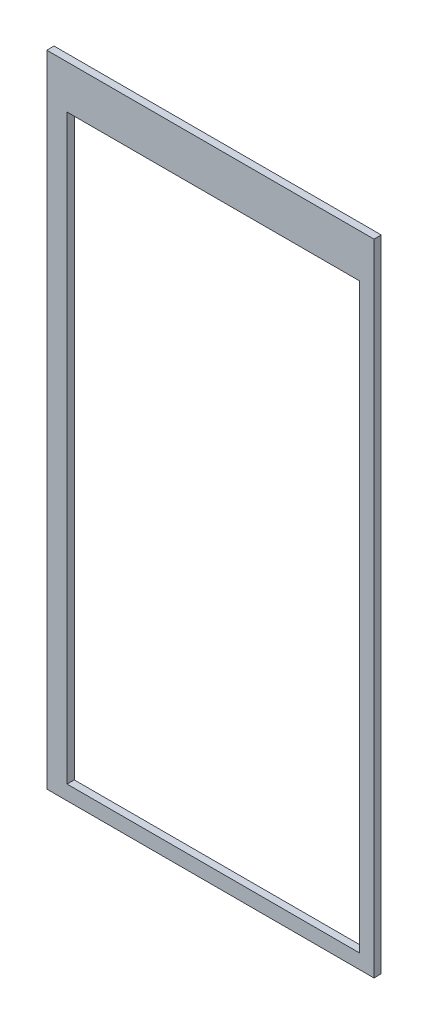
ISO-10303-21;
HEADER;
FILE_DESCRIPTION(('STEP AP214'),'2;1');
FILE_NAME('part.step','',(''),(''),'','','');
FILE_SCHEMA(('AUTOMOTIVE_DESIGN { 1 0 10303 214 1 1 1 1 }'));
ENDSEC;
DATA;
#1=APPLICATION_CONTEXT('core data for automotive mechanical design processes');
#2=APPLICATION_PROTOCOL_DEFINITION('international standard','automotive_design',2000,#1);
#3=PRODUCT_CONTEXT('',#1,'mechanical');
#4=PRODUCT('Part','Part','',(#3));
#5=PRODUCT_RELATED_PRODUCT_CATEGORY('part','',(#4));
#6=PRODUCT_DEFINITION_FORMATION('','',#4);
#7=PRODUCT_DEFINITION_CONTEXT('part definition',#1,'design');
#8=PRODUCT_DEFINITION('design','',#6,#7);
#9=PRODUCT_DEFINITION_SHAPE('','',#8);
#10=(LENGTH_UNIT() NAMED_UNIT(*) SI_UNIT(.MILLI.,.METRE.));
#11=(NAMED_UNIT(*) PLANE_ANGLE_UNIT() SI_UNIT($,.RADIAN.));
#12=(NAMED_UNIT(*) SI_UNIT($,.STERADIAN.) SOLID_ANGLE_UNIT());
#13=UNCERTAINTY_MEASURE_WITH_UNIT(LENGTH_MEASURE(1.E-05),#10,'distance_accuracy_value','');
#14=(GEOMETRIC_REPRESENTATION_CONTEXT(3) GLOBAL_UNCERTAINTY_ASSIGNED_CONTEXT((#13)) GLOBAL_UNIT_ASSIGNED_CONTEXT((#10,
#11,#12)) REPRESENTATION_CONTEXT('',''));
#15=CARTESIAN_POINT('',(0.,0.,0.));
#16=DIRECTION('',(0.,0.,1.));
#17=DIRECTION('',(1.,0.,0.));
#18=AXIS2_PLACEMENT_3D('',#15,#16,#17);
#19=CARTESIAN_POINT('',(-1017.5,65.0000000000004,-17.5));
#20=DIRECTION('',(0.,1.,0.));
#21=DIRECTION('',(1.,0.,0.));
#22=AXIS2_PLACEMENT_3D('',#19,#20,#21);
#23=CYLINDRICAL_SURFACE('',#22,2.5);
#24=DIRECTION('',(0.,1.,0.));
#25=VECTOR('',#24,1.);
#26=CARTESIAN_POINT('',(-1017.5,65.0000000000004,-15.));
#27=LINE('',#26,#25);
#28=CARTESIAN_POINT('',(-1017.5,65.0000000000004,-15.));
#29=VERTEX_POINT('',#28);
#30=CARTESIAN_POINT('',(-1017.5,85.1265822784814,-15.));
#31=VERTEX_POINT('',#30);
#32=EDGE_CURVE('P0_E222',#29,#31,#27,.T.);
#33=ORIENTED_EDGE('',*,*,#32,.T.);
#34=CARTESIAN_POINT('',(-1017.5,85.1265822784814,-17.5));
#35=DIRECTION('',(0.,1.,0.));
#36=DIRECTION('',(1.,0.,0.));
#37=AXIS2_PLACEMENT_3D('',#34,#35,#36);
#38=CIRCLE('',#37,2.5);
#39=CARTESIAN_POINT('',(-1019.5,85.1265822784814,-16.));
#40=VERTEX_POINT('',#39);
#41=EDGE_CURVE('P0_E12',#31,#40,#38,.T.);
#42=ORIENTED_EDGE('',*,*,#41,.T.);
#43=DIRECTION('',(0.,1.,0.));
#44=VECTOR('',#43,1.);
#45=CARTESIAN_POINT('',(-1019.5,65.0000000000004,-16.));
#46=LINE('',#45,#44);
#47=CARTESIAN_POINT('',(-1019.5,65.0000000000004,-16.));
#48=VERTEX_POINT('',#47);
#49=EDGE_CURVE('P0_E216',#48,#40,#46,.T.);
#50=ORIENTED_EDGE('',*,*,#49,.F.);
#51=CARTESIAN_POINT('',(-1017.5,65.0000000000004,-17.5));
#52=DIRECTION('',(0.,-1.,0.));
#53=DIRECTION('',(-1.,0.,0.));
#54=AXIS2_PLACEMENT_3D('',#51,#52,#53);
#55=CIRCLE('',#54,2.5);
#56=EDGE_CURVE('P0_E206',#48,#29,#55,.T.);
#57=ORIENTED_EDGE('',*,*,#56,.T.);
#58=EDGE_LOOP('',(#33,#42,#50,#57));
#59=FACE_BOUND('',#58,.T.);
#60=ADVANCED_FACE('P0_F47',(#59),#23,.F.);
#61=CARTESIAN_POINT('',(-1017.5,147.5,-15.));
#62=VERTEX_POINT('',#61);
#63=CARTESIAN_POINT('',(-1017.5,165.084388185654,-15.));
#64=VERTEX_POINT('',#63);
#65=EDGE_CURVE('P0_E226',#62,#64,#27,.T.);
#66=ORIENTED_EDGE('',*,*,#65,.T.);
#67=CARTESIAN_POINT('',(-1017.5,165.084388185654,-17.5));
#68=DIRECTION('',(0.,1.,0.));
#69=DIRECTION('',(1.,0.,0.));
#70=AXIS2_PLACEMENT_3D('',#67,#68,#69);
#71=CIRCLE('',#70,2.5);
#72=CARTESIAN_POINT('',(-1019.5,165.084388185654,-16.));
#73=VERTEX_POINT('',#72);
#74=EDGE_CURVE('P0_E56',#64,#73,#71,.T.);
#75=ORIENTED_EDGE('',*,*,#74,.T.);
#76=CARTESIAN_POINT('',(-1019.5,147.5,-16.));
#77=VERTEX_POINT('',#76);
#78=EDGE_CURVE('P0_E221',#77,#73,#46,.T.);
#79=ORIENTED_EDGE('',*,*,#78,.F.);
#80=CARTESIAN_POINT('',(-1017.5,147.5,-17.5));
#81=DIRECTION('',(0.,1.,0.));
#82=DIRECTION('',(1.,0.,0.));
#83=AXIS2_PLACEMENT_3D('',#80,#81,#82);
#84=CIRCLE('',#83,2.5);
#85=EDGE_CURVE('P0_E269',#62,#77,#84,.T.);
#86=ORIENTED_EDGE('',*,*,#85,.F.);
#87=EDGE_LOOP('',(#66,#75,#79,#86));
#88=FACE_BOUND('',#87,.T.);
#89=ADVANCED_FACE('P0_F242',(#88),#23,.F.);
#90=CARTESIAN_POINT('',(-1017.5,65.0000000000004,-17.5));
#91=DIRECTION('',(0.,1.,0.));
#92=DIRECTION('',(1.,0.,0.));
#93=AXIS2_PLACEMENT_3D('',#90,#91,#92);
#94=CYLINDRICAL_SURFACE('',#93,5.);
#95=DIRECTION('',(0.,1.,0.));
#96=VECTOR('',#95,1.);
#97=CARTESIAN_POINT('',(-1022.26969600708,65.0000000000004,-16.));
#98=LINE('',#97,#96);
#99=CARTESIAN_POINT('',(-1022.26969600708,65.0000000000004,-16.));
#100=VERTEX_POINT('',#99);
#101=CARTESIAN_POINT('',(-1022.26969600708,107.500000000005,-16.));
#102=VERTEX_POINT('',#101);
#103=EDGE_CURVE('P0_E213',#100,#102,#98,.T.);
#104=ORIENTED_EDGE('',*,*,#103,.T.);
#105=CARTESIAN_POINT('',(-1017.5,107.500000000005,-17.5));
#106=DIRECTION('',(0.,1.,0.));
#107=DIRECTION('',(0.,0.,-1.));
#108=AXIS2_PLACEMENT_3D('',#105,#106,#107);
#109=CIRCLE('',#108,5.00000000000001);
#110=CARTESIAN_POINT('',(-1017.5,107.500000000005,-12.5));
#111=VERTEX_POINT('',#110);
#112=EDGE_CURVE('P0_E155',#111,#102,#109,.T.);
#113=ORIENTED_EDGE('',*,*,#112,.F.);
#114=DIRECTION('',(0.,1.,0.));
#115=VECTOR('',#114,1.);
#116=CARTESIAN_POINT('',(-1017.5,65.0000000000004,-12.5));
#117=LINE('',#116,#115);
#118=CARTESIAN_POINT('',(-1017.5,65.0000000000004,-12.5));
#119=VERTEX_POINT('',#118);
#120=EDGE_CURVE('P0_E151',#119,#111,#117,.T.);
#121=ORIENTED_EDGE('',*,*,#120,.F.);
#122=CARTESIAN_POINT('',(-1017.5,65.0000000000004,-17.5));
#123=DIRECTION('',(0.,-1.,0.));
#124=DIRECTION('',(-1.,0.,0.));
#125=AXIS2_PLACEMENT_3D('',#122,#123,#124);
#126=CIRCLE('',#125,5.);
#127=EDGE_CURVE('P0_E194',#100,#119,#126,.T.);
#128=ORIENTED_EDGE('',*,*,#127,.F.);
#129=EDGE_LOOP('',(#104,#113,#121,#128));
#130=FACE_BOUND('',#129,.T.);
#131=ADVANCED_FACE('P0_F297',(#130),#94,.T.);
#132=ORIENTED_EDGE('',*,*,#41,.F.);
#133=CARTESIAN_POINT('',(-1017.5,107.500000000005,-15.));
#134=VERTEX_POINT('',#133);
#135=EDGE_CURVE('P0_E225',#31,#134,#27,.T.);
#136=ORIENTED_EDGE('',*,*,#135,.T.);
#137=CARTESIAN_POINT('',(-1017.5,107.500000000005,-17.5));
#138=DIRECTION('',(0.,1.,0.));
#139=DIRECTION('',(0.,0.,-1.));
#140=AXIS2_PLACEMENT_3D('',#137,#138,#139);
#141=CIRCLE('',#140,2.5);
#142=CARTESIAN_POINT('',(-1019.5,107.500000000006,-16.));
#143=VERTEX_POINT('',#142);
#144=EDGE_CURVE('P0_E261',#143,#134,#141,.F.);
#145=ORIENTED_EDGE('',*,*,#144,.F.);
#146=EDGE_CURVE('P0_E220',#40,#143,#46,.T.);
#147=ORIENTED_EDGE('',*,*,#146,.F.);
#148=EDGE_LOOP('',(#132,#136,#145,#147));
#149=FACE_BOUND('',#148,.T.);
#150=ADVANCED_FACE('P0_F262',(#149),#23,.F.);
#151=CARTESIAN_POINT('',(-1022.26969600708,65.0000000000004,-16.));
#152=DIRECTION('',(0.,0.,1.));
#153=DIRECTION('',(-1.,0.,0.));
#154=AXIS2_PLACEMENT_3D('',#151,#152,#153);
#155=PLANE('',#154);
#156=ORIENTED_EDGE('',*,*,#146,.T.);
#157=DIRECTION('',(1.,0.,0.));
#158=VECTOR('',#157,1.);
#159=CARTESIAN_POINT('',(-1022.26969600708,107.500000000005,-16.));
#160=LINE('',#159,#158);
#161=EDGE_CURVE('P0_E260',#102,#143,#160,.T.);
#162=ORIENTED_EDGE('',*,*,#161,.F.);
#163=ORIENTED_EDGE('',*,*,#103,.F.);
#164=DIRECTION('',(1.,0.,0.));
#165=VECTOR('',#164,1.);
#166=CARTESIAN_POINT('',(-1022.26969600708,65.0000000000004,-16.));
#167=LINE('',#166,#165);
#168=EDGE_CURVE('P0_E209',#100,#48,#167,.T.);
#169=ORIENTED_EDGE('',*,*,#168,.T.);
#170=ORIENTED_EDGE('',*,*,#49,.T.);
#171=EDGE_LOOP('',(#156,#162,#163,#169,#170));
#172=FACE_BOUND('',#171,.T.);
#173=ADVANCED_FACE('P0_F258',(#172),#155,.T.);
#174=CARTESIAN_POINT('',(-1017.5,147.5,-12.5));
#175=VERTEX_POINT('',#174);
#176=CARTESIAN_POINT('',(-1017.5,185.,-12.5));
#177=VERTEX_POINT('',#176);
#178=EDGE_CURVE('P0_E230',#175,#177,#117,.T.);
#179=ORIENTED_EDGE('',*,*,#178,.F.);
#180=CARTESIAN_POINT('',(-1017.5,147.5,-17.5));
#181=DIRECTION('',(0.,1.,0.));
#182=DIRECTION('',(1.,0.,0.));
#183=AXIS2_PLACEMENT_3D('',#180,#181,#182);
#184=CIRCLE('',#183,5.);
#185=CARTESIAN_POINT('',(-1022.26969600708,147.5,-16.));
#186=VERTEX_POINT('',#185);
#187=EDGE_CURVE('P0_E176',#175,#186,#184,.T.);
#188=ORIENTED_EDGE('',*,*,#187,.T.);
#189=CARTESIAN_POINT('',(-1022.26969600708,185.,-16.));
#190=VERTEX_POINT('',#189);
#191=EDGE_CURVE('P0_E212',#186,#190,#98,.T.);
#192=ORIENTED_EDGE('',*,*,#191,.T.);
#193=CARTESIAN_POINT('',(-1017.5,185.,-17.5));
#194=DIRECTION('',(0.,-1.,0.));
#195=DIRECTION('',(-1.,0.,0.));
#196=AXIS2_PLACEMENT_3D('',#193,#194,#195);
#197=CIRCLE('',#196,5.);
#198=EDGE_CURVE('P0_E170',#190,#177,#197,.T.);
#199=ORIENTED_EDGE('',*,*,#198,.T.);
#200=EDGE_LOOP('',(#179,#188,#192,#199));
#201=FACE_BOUND('',#200,.T.);
#202=ADVANCED_FACE('P0_F275',(#201),#94,.T.);
#203=CARTESIAN_POINT('',(-1017.5,65.0000000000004,-12.5));
#204=DIRECTION('',(0.,0.,-1.));
#205=DIRECTION('',(0.,-1.,0.));
#206=AXIS2_PLACEMENT_3D('',#203,#204,#205);
#207=PLANE('',#206);
#208=ORIENTED_EDGE('',*,*,#120,.T.);
#209=DIRECTION('',(1.,0.,0.));
#210=VECTOR('',#209,1.);
#211=CARTESIAN_POINT('',(-1017.5,107.500000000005,-12.5));
#212=LINE('',#211,#210);
#213=CARTESIAN_POINT('',(-1025.,107.500000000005,-12.5));
#214=VERTEX_POINT('',#213);
#215=EDGE_CURVE('P0_E145',#214,#111,#212,.T.);
#216=ORIENTED_EDGE('',*,*,#215,.F.);
#217=DIRECTION('',(0.,-1.,0.));
#218=VECTOR('',#217,1.);
#219=CARTESIAN_POINT('',(-1025.,65.0000000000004,-12.5));
#220=LINE('',#219,#218);
#221=CARTESIAN_POINT('',(-1025.,147.5,-12.5));
#222=VERTEX_POINT('',#221);
#223=EDGE_CURVE('P0_E149',#222,#214,#220,.T.);
#224=ORIENTED_EDGE('',*,*,#223,.F.);
#225=DIRECTION('',(1.,0.,0.));
#226=VECTOR('',#225,1.);
#227=CARTESIAN_POINT('',(-1017.5,147.5,-12.5));
#228=LINE('',#227,#226);
#229=EDGE_CURVE('P0_E171',#222,#175,#228,.T.);
#230=ORIENTED_EDGE('',*,*,#229,.T.);
#231=ORIENTED_EDGE('',*,*,#178,.T.);
#232=DIRECTION('',(-1.,0.,0.));
#233=VECTOR('',#232,1.);
#234=CARTESIAN_POINT('',(-1017.5,185.,-12.5));
#235=LINE('',#234,#233);
#236=CARTESIAN_POINT('',(-1077.5,185.,-12.5));
#237=VERTEX_POINT('',#236);
#238=EDGE_CURVE('P0_E174',#177,#237,#235,.T.);
#239=ORIENTED_EDGE('',*,*,#238,.T.);
#240=DIRECTION('',(0.,1.,0.));
#241=VECTOR('',#240,1.);
#242=CARTESIAN_POINT('',(-1077.5,65.0000000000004,-12.5));
#243=LINE('',#242,#241);
#244=CARTESIAN_POINT('',(-1077.5,65.0000000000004,-12.5));
#245=VERTEX_POINT('',#244);
#246=EDGE_CURVE('P0_E228',#245,#237,#243,.T.);
#247=ORIENTED_EDGE('',*,*,#246,.F.);
#248=DIRECTION('',(-1.,0.,0.));
#249=VECTOR('',#248,1.);
#250=CARTESIAN_POINT('',(-1017.5,65.0000000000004,-12.5));
#251=LINE('',#250,#249);
#252=EDGE_CURVE('P0_E197',#119,#245,#251,.T.);
#253=ORIENTED_EDGE('',*,*,#252,.F.);
#254=EDGE_LOOP('',(#208,#216,#224,#230,#231,#239,#247,#253));
#255=FACE_BOUND('',#254,.T.);
#256=ADVANCED_FACE('P0_F49',(#255),#207,.F.);
#257=CARTESIAN_POINT('',(-1077.5,65.0000000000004,-12.5));
#258=DIRECTION('',(1.,0.,0.));
#259=DIRECTION('',(0.,-1.,0.));
#260=AXIS2_PLACEMENT_3D('',#257,#258,#259);
#261=PLANE('',#260);
#262=DIRECTION('',(0.,1.,0.));
#263=VECTOR('',#262,1.);
#264=CARTESIAN_POINT('',(-1077.5,65.0000000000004,-15.));
#265=LINE('',#264,#263);
#266=CARTESIAN_POINT('',(-1077.5,65.0000000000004,-15.));
#267=VERTEX_POINT('',#266);
#268=CARTESIAN_POINT('',(-1077.5,185.,-15.));
#269=VERTEX_POINT('',#268);
#270=EDGE_CURVE('P0_E224',#267,#269,#265,.T.);
#271=ORIENTED_EDGE('',*,*,#270,.F.);
#272=DIRECTION('',(0.,0.,-1.));
#273=VECTOR('',#272,1.);
#274=CARTESIAN_POINT('',(-1077.5,65.0000000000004,-12.5));
#275=LINE('',#274,#273);
#276=EDGE_CURVE('P0_E200',#245,#267,#275,.T.);
#277=ORIENTED_EDGE('',*,*,#276,.F.);
#278=ORIENTED_EDGE('',*,*,#246,.T.);
#279=DIRECTION('',(0.,0.,-1.));
#280=VECTOR('',#279,1.);
#281=CARTESIAN_POINT('',(-1077.5,185.,-12.5));
#282=LINE('',#281,#280);
#283=EDGE_CURVE('P0_E182',#237,#269,#282,.T.);
#284=ORIENTED_EDGE('',*,*,#283,.T.);
#285=EDGE_LOOP('',(#271,#277,#278,#284));
#286=FACE_BOUND('',#285,.T.);
#287=ADVANCED_FACE('P0_F290',(#286),#261,.F.);
#288=CARTESIAN_POINT('',(-1017.5,65.0000000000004,-15.));
#289=DIRECTION('',(0.,0.,-1.));
#290=DIRECTION('',(0.,-1.,0.));
#291=AXIS2_PLACEMENT_3D('',#288,#289,#290);
#292=PLANE('',#291);
#293=DIRECTION('',(0.,-1.,0.));
#294=VECTOR('',#293,1.);
#295=CARTESIAN_POINT('',(-1025.,65.0000000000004,-15.));
#296=LINE('',#295,#294);
#297=CARTESIAN_POINT('',(-1025.,147.5,-15.));
#298=VERTEX_POINT('',#297);
#299=CARTESIAN_POINT('',(-1025.,107.500000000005,-15.));
#300=VERTEX_POINT('',#299);
#301=EDGE_CURVE('P0_E234',#298,#300,#296,.T.);
#302=ORIENTED_EDGE('',*,*,#301,.T.);
#303=DIRECTION('',(-1.,0.,0.));
#304=VECTOR('',#303,1.);
#305=CARTESIAN_POINT('',(-1017.5,107.500000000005,-15.));
#306=LINE('',#305,#304);
#307=EDGE_CURVE('P0_E162',#134,#300,#306,.T.);
#308=ORIENTED_EDGE('',*,*,#307,.F.);
#309=ORIENTED_EDGE('',*,*,#135,.F.);
#310=ORIENTED_EDGE('',*,*,#32,.F.);
#311=DIRECTION('',(-1.,0.,0.));
#312=VECTOR('',#311,1.);
#313=CARTESIAN_POINT('',(-1017.5,65.0000000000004,-15.));
#314=LINE('',#313,#312);
#315=EDGE_CURVE('P0_E203',#29,#267,#314,.T.);
#316=ORIENTED_EDGE('',*,*,#315,.T.);
#317=ORIENTED_EDGE('',*,*,#270,.T.);
#318=DIRECTION('',(-1.,0.,0.));
#319=VECTOR('',#318,1.);
#320=CARTESIAN_POINT('',(-1017.5,185.,-15.));
#321=LINE('',#320,#319);
#322=CARTESIAN_POINT('',(-1017.5,185.,-15.));
#323=VERTEX_POINT('',#322);
#324=EDGE_CURVE('P0_E185',#323,#269,#321,.T.);
#325=ORIENTED_EDGE('',*,*,#324,.F.);
#326=EDGE_CURVE('P0_E219',#64,#323,#27,.T.);
#327=ORIENTED_EDGE('',*,*,#326,.F.);
#328=ORIENTED_EDGE('',*,*,#65,.F.);
#329=DIRECTION('',(1.,0.,0.));
#330=VECTOR('',#329,1.);
#331=CARTESIAN_POINT('',(-1017.5,147.5,-15.));
#332=LINE('',#331,#330);
#333=EDGE_CURVE('P0_E271',#298,#62,#332,.T.);
#334=ORIENTED_EDGE('',*,*,#333,.F.);
#335=EDGE_LOOP('',(#302,#308,#309,#310,#316,#317,#325,#327,#328,#334));
#336=FACE_BOUND('',#335,.T.);
#337=ADVANCED_FACE('P0_F285',(#336),#292,.T.);
#338=ORIENTED_EDGE('',*,*,#74,.F.);
#339=ORIENTED_EDGE('',*,*,#326,.T.);
#340=CARTESIAN_POINT('',(-1017.5,185.,-17.5));
#341=DIRECTION('',(0.,-1.,0.));
#342=DIRECTION('',(-1.,0.,0.));
#343=AXIS2_PLACEMENT_3D('',#340,#341,#342);
#344=CIRCLE('',#343,2.5);
#345=CARTESIAN_POINT('',(-1019.5,185.,-16.));
#346=VERTEX_POINT('',#345);
#347=EDGE_CURVE('P0_E188',#346,#323,#344,.T.);
#348=ORIENTED_EDGE('',*,*,#347,.F.);
#349=EDGE_CURVE('P0_E215',#73,#346,#46,.T.);
#350=ORIENTED_EDGE('',*,*,#349,.F.);
#351=EDGE_LOOP('',(#338,#339,#348,#350));
#352=FACE_BOUND('',#351,.T.);
#353=ADVANCED_FACE('P0_F249',(#352),#23,.F.);
#354=DIRECTION('',(-1.,0.,0.));
#355=VECTOR('',#354,1.);
#356=CARTESIAN_POINT('',(-1022.26969600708,147.5,-16.));
#357=LINE('',#356,#355);
#358=EDGE_CURVE('P0_E232',#77,#186,#357,.T.);
#359=ORIENTED_EDGE('',*,*,#358,.F.);
#360=ORIENTED_EDGE('',*,*,#78,.T.);
#361=ORIENTED_EDGE('',*,*,#349,.T.);
#362=DIRECTION('',(1.,0.,0.));
#363=VECTOR('',#362,1.);
#364=CARTESIAN_POINT('',(-1022.26969600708,185.,-16.));
#365=LINE('',#364,#363);
#366=EDGE_CURVE('P0_E191',#190,#346,#365,.T.);
#367=ORIENTED_EDGE('',*,*,#366,.F.);
#368=ORIENTED_EDGE('',*,*,#191,.F.);
#369=EDGE_LOOP('',(#359,#360,#361,#367,#368));
#370=FACE_BOUND('',#369,.T.);
#371=ADVANCED_FACE('P0_F253',(#370),#155,.T.);
#372=CARTESIAN_POINT('',(-1017.5,65.0000000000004,-17.5));
#373=DIRECTION('',(0.,-1.,0.));
#374=DIRECTION('',(-1.,0.,0.));
#375=AXIS2_PLACEMENT_3D('',#372,#373,#374);
#376=PLANE('',#375);
#377=ORIENTED_EDGE('',*,*,#127,.T.);
#378=ORIENTED_EDGE('',*,*,#252,.T.);
#379=ORIENTED_EDGE('',*,*,#276,.T.);
#380=ORIENTED_EDGE('',*,*,#315,.F.);
#381=ORIENTED_EDGE('',*,*,#56,.F.);
#382=ORIENTED_EDGE('',*,*,#168,.F.);
#383=EDGE_LOOP('',(#377,#378,#379,#380,#381,#382));
#384=FACE_BOUND('',#383,.T.);
#385=ADVANCED_FACE('P0_F292',(#384),#376,.T.);
#386=CARTESIAN_POINT('',(-1017.5,185.,-17.5));
#387=DIRECTION('',(0.,-1.,0.));
#388=DIRECTION('',(-1.,0.,0.));
#389=AXIS2_PLACEMENT_3D('',#386,#387,#388);
#390=PLANE('',#389);
#391=ORIENTED_EDGE('',*,*,#198,.F.);
#392=ORIENTED_EDGE('',*,*,#366,.T.);
#393=ORIENTED_EDGE('',*,*,#347,.T.);
#394=ORIENTED_EDGE('',*,*,#324,.T.);
#395=ORIENTED_EDGE('',*,*,#283,.F.);
#396=ORIENTED_EDGE('',*,*,#238,.F.);
#397=EDGE_LOOP('',(#391,#392,#393,#394,#395,#396));
#398=FACE_BOUND('',#397,.T.);
#399=ADVANCED_FACE('P0_F279',(#398),#390,.F.);
#400=CARTESIAN_POINT('',(-1025.,102.5,-48.6936528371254));
#401=DIRECTION('',(1.,0.,0.));
#402=DIRECTION('',(0.,-1.,0.));
#403=AXIS2_PLACEMENT_3D('',#400,#401,#402);
#404=PLANE('',#403);
#405=DIRECTION('',(0.,0.,1.));
#406=VECTOR('',#405,1.);
#407=CARTESIAN_POINT('',(-1025.,107.500000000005,-15.0000000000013));
#408=LINE('',#407,#406);
#409=EDGE_CURVE('P0_E158',#300,#214,#408,.T.);
#410=ORIENTED_EDGE('',*,*,#409,.F.);
#411=ORIENTED_EDGE('',*,*,#301,.F.);
#412=DIRECTION('',(0.,0.,1.));
#413=VECTOR('',#412,1.);
#414=CARTESIAN_POINT('',(-1025.,147.5,-48.6936528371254));
#415=LINE('',#414,#413);
#416=EDGE_CURVE('P0_E165',#298,#222,#415,.T.);
#417=ORIENTED_EDGE('',*,*,#416,.T.);
#418=ORIENTED_EDGE('',*,*,#223,.T.);
#419=EDGE_LOOP('',(#410,#411,#417,#418));
#420=FACE_BOUND('',#419,.T.);
#421=ADVANCED_FACE('P0_F168',(#420),#404,.T.);
#422=CARTESIAN_POINT('',(-975.,147.5,-48.6936528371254));
#423=DIRECTION('',(0.,1.,0.));
#424=DIRECTION('',(1.,0.,0.));
#425=AXIS2_PLACEMENT_3D('',#422,#423,#424);
#426=PLANE('',#425);
#427=ORIENTED_EDGE('',*,*,#416,.F.);
#428=ORIENTED_EDGE('',*,*,#333,.T.);
#429=ORIENTED_EDGE('',*,*,#85,.T.);
#430=ORIENTED_EDGE('',*,*,#358,.T.);
#431=ORIENTED_EDGE('',*,*,#187,.F.);
#432=ORIENTED_EDGE('',*,*,#229,.F.);
#433=EDGE_LOOP('',(#427,#428,#429,#430,#431,#432));
#434=FACE_BOUND('',#433,.T.);
#435=ADVANCED_FACE('P0_F282',(#434),#426,.F.);
#436=CARTESIAN_POINT('',(-1049.10316460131,107.500000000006,-23.0257546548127));
#437=DIRECTION('',(0.,1.,0.));
#438=DIRECTION('',(-0.0628151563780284,0.,-0.998025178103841));
#439=AXIS2_PLACEMENT_3D('',#436,#437,#438);
#440=PLANE('',#439);
#441=ORIENTED_EDGE('',*,*,#215,.T.);
#442=ORIENTED_EDGE('',*,*,#112,.T.);
#443=ORIENTED_EDGE('',*,*,#161,.T.);
#444=ORIENTED_EDGE('',*,*,#144,.T.);
#445=ORIENTED_EDGE('',*,*,#307,.T.);
#446=ORIENTED_EDGE('',*,*,#409,.T.);
#447=EDGE_LOOP('',(#441,#442,#443,#444,#445,#446));
#448=FACE_BOUND('',#447,.T.);
#449=ADVANCED_FACE('P0_F159',(#448),#440,.T.);
#450=CLOSED_SHELL('',(#60,#89,#131,#150,#173,#202,#256,#287,#337,#353,#371,#385,#399,#421,#435,#449));
#451=MANIFOLD_SOLID_BREP('P0_B2',#450);
#452=CARTESIAN_POINT('',(-1017.5,1745.,-17.5000000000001));
#453=DIRECTION('',(0.,1.,0.));
#454=DIRECTION('',(1.,0.,0.));
#455=AXIS2_PLACEMENT_3D('',#452,#453,#454);
#456=CYLINDRICAL_SURFACE('',#455,2.5);
#457=DIRECTION('',(0.,1.,0.));
#458=VECTOR('',#457,1.);
#459=CARTESIAN_POINT('',(-1017.5,1745.,-15.0000000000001));
#460=LINE('',#459,#458);
#461=CARTESIAN_POINT('',(-1017.5,1745.,-15.0000000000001));
#462=VERTEX_POINT('',#461);
#463=CARTESIAN_POINT('',(-1017.5,1765.12658227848,-15.0000000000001));
#464=VERTEX_POINT('',#463);
#465=EDGE_CURVE('P0_E626',#462,#464,#460,.T.);
#466=ORIENTED_EDGE('',*,*,#465,.T.);
#467=CARTESIAN_POINT('',(-1017.5,1765.12658227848,-17.5000000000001));
#468=DIRECTION('',(0.,1.,0.));
#469=DIRECTION('',(1.,0.,0.));
#470=AXIS2_PLACEMENT_3D('',#467,#468,#469);
#471=CIRCLE('',#470,2.5);
#472=CARTESIAN_POINT('',(-1019.5,1765.12658227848,-16.));
#473=VERTEX_POINT('',#472);
#474=EDGE_CURVE('P0_E45',#464,#473,#471,.T.);
#475=ORIENTED_EDGE('',*,*,#474,.T.);
#476=DIRECTION('',(0.,1.,0.));
#477=VECTOR('',#476,1.);
#478=CARTESIAN_POINT('',(-1019.5,1745.,-16.));
#479=LINE('',#478,#477);
#480=CARTESIAN_POINT('',(-1019.5,1745.,-16.));
#481=VERTEX_POINT('',#480);
#482=EDGE_CURVE('P0_E620',#481,#473,#479,.T.);
#483=ORIENTED_EDGE('',*,*,#482,.F.);
#484=CARTESIAN_POINT('',(-1017.5,1745.,-17.5000000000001));
#485=DIRECTION('',(0.,-1.,0.));
#486=DIRECTION('',(-1.,0.,0.));
#487=AXIS2_PLACEMENT_3D('',#484,#485,#486);
#488=CIRCLE('',#487,2.5);
#489=EDGE_CURVE('P0_E610',#481,#462,#488,.T.);
#490=ORIENTED_EDGE('',*,*,#489,.T.);
#491=EDGE_LOOP('',(#466,#475,#483,#490));
#492=FACE_BOUND('',#491,.T.);
#493=ADVANCED_FACE('P0_F451',(#492),#456,.F.);
#494=CARTESIAN_POINT('',(-1017.5,1827.5,-15.0000000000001));
#495=VERTEX_POINT('',#494);
#496=CARTESIAN_POINT('',(-1017.5,1845.08438818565,-15.0000000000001));
#497=VERTEX_POINT('',#496);
#498=EDGE_CURVE('P0_E630',#495,#497,#460,.T.);
#499=ORIENTED_EDGE('',*,*,#498,.T.);
#500=CARTESIAN_POINT('',(-1017.5,1845.08438818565,-17.5000000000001));
#501=DIRECTION('',(0.,1.,0.));
#502=DIRECTION('',(1.,0.,0.));
#503=AXIS2_PLACEMENT_3D('',#500,#501,#502);
#504=CIRCLE('',#503,2.5);
#505=CARTESIAN_POINT('',(-1019.5,1845.08438818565,-16.));
#506=VERTEX_POINT('',#505);
#507=EDGE_CURVE('P0_E460',#497,#506,#504,.T.);
#508=ORIENTED_EDGE('',*,*,#507,.T.);
#509=CARTESIAN_POINT('',(-1019.5,1827.5,-16.));
#510=VERTEX_POINT('',#509);
#511=EDGE_CURVE('P0_E625',#510,#506,#479,.T.);
#512=ORIENTED_EDGE('',*,*,#511,.F.);
#513=CARTESIAN_POINT('',(-1017.5,1827.5,-17.5000000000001));
#514=DIRECTION('',(0.,1.,0.));
#515=DIRECTION('',(1.,0.,0.));
#516=AXIS2_PLACEMENT_3D('',#513,#514,#515);
#517=CIRCLE('',#516,2.5);
#518=EDGE_CURVE('P0_E673',#495,#510,#517,.T.);
#519=ORIENTED_EDGE('',*,*,#518,.F.);
#520=EDGE_LOOP('',(#499,#508,#512,#519));
#521=FACE_BOUND('',#520,.T.);
#522=ADVANCED_FACE('P0_F646',(#521),#456,.F.);
#523=CARTESIAN_POINT('',(-1017.5,1745.,-17.5000000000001));
#524=DIRECTION('',(0.,1.,0.));
#525=DIRECTION('',(1.,0.,0.));
#526=AXIS2_PLACEMENT_3D('',#523,#524,#525);
#527=CYLINDRICAL_SURFACE('',#526,5.);
#528=DIRECTION('',(0.,1.,0.));
#529=VECTOR('',#528,1.);
#530=CARTESIAN_POINT('',(-1022.26969600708,1745.,-16.));
#531=LINE('',#530,#529);
#532=CARTESIAN_POINT('',(-1022.26969600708,1745.,-16.));
#533=VERTEX_POINT('',#532);
#534=CARTESIAN_POINT('',(-1022.26969600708,1787.50000000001,-16.));
#535=VERTEX_POINT('',#534);
#536=EDGE_CURVE('P0_E617',#533,#535,#531,.T.);
#537=ORIENTED_EDGE('',*,*,#536,.T.);
#538=CARTESIAN_POINT('',(-1017.5,1787.50000000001,-17.5000000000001));
#539=DIRECTION('',(0.,1.,0.));
#540=DIRECTION('',(0.,0.,-1.));
#541=AXIS2_PLACEMENT_3D('',#538,#539,#540);
#542=CIRCLE('',#541,5.00000000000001);
#543=CARTESIAN_POINT('',(-1017.5,1787.5,-12.5000000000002));
#544=VERTEX_POINT('',#543);
#545=EDGE_CURVE('P0_E559',#544,#535,#542,.T.);
#546=ORIENTED_EDGE('',*,*,#545,.F.);
#547=DIRECTION('',(0.,1.,0.));
#548=VECTOR('',#547,1.);
#549=CARTESIAN_POINT('',(-1017.5,1745.,-12.5000000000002));
#550=LINE('',#549,#548);
#551=CARTESIAN_POINT('',(-1017.5,1745.,-12.5000000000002));
#552=VERTEX_POINT('',#551);
#553=EDGE_CURVE('P0_E555',#552,#544,#550,.T.);
#554=ORIENTED_EDGE('',*,*,#553,.F.);
#555=CARTESIAN_POINT('',(-1017.5,1745.,-17.5000000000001));
#556=DIRECTION('',(0.,-1.,0.));
#557=DIRECTION('',(-1.,0.,0.));
#558=AXIS2_PLACEMENT_3D('',#555,#556,#557);
#559=CIRCLE('',#558,5.);
#560=EDGE_CURVE('P0_E598',#533,#552,#559,.T.);
#561=ORIENTED_EDGE('',*,*,#560,.F.);
#562=EDGE_LOOP('',(#537,#546,#554,#561));
#563=FACE_BOUND('',#562,.T.);
#564=ADVANCED_FACE('P0_F701',(#563),#527,.T.);
#565=ORIENTED_EDGE('',*,*,#474,.F.);
#566=CARTESIAN_POINT('',(-1017.5,1787.50000000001,-15.0000000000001));
#567=VERTEX_POINT('',#566);
#568=EDGE_CURVE('P0_E629',#464,#567,#460,.T.);
#569=ORIENTED_EDGE('',*,*,#568,.T.);
#570=CARTESIAN_POINT('',(-1017.5,1787.50000000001,-17.5000000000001));
#571=DIRECTION('',(0.,1.,0.));
#572=DIRECTION('',(0.,0.,-1.));
#573=AXIS2_PLACEMENT_3D('',#570,#571,#572);
#574=CIRCLE('',#573,2.5);
#575=CARTESIAN_POINT('',(-1019.5,1787.50000000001,-16.));
#576=VERTEX_POINT('',#575);
#577=EDGE_CURVE('P0_E665',#576,#567,#574,.F.);
#578=ORIENTED_EDGE('',*,*,#577,.F.);
#579=EDGE_CURVE('P0_E624',#473,#576,#479,.T.);
#580=ORIENTED_EDGE('',*,*,#579,.F.);
#581=EDGE_LOOP('',(#565,#569,#578,#580));
#582=FACE_BOUND('',#581,.T.);
#583=ADVANCED_FACE('P0_F666',(#582),#456,.F.);
#584=CARTESIAN_POINT('',(-1022.26969600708,1745.,-16.));
#585=DIRECTION('',(0.,0.,1.));
#586=DIRECTION('',(-1.,0.,0.));
#587=AXIS2_PLACEMENT_3D('',#584,#585,#586);
#588=PLANE('',#587);
#589=ORIENTED_EDGE('',*,*,#579,.T.);
#590=DIRECTION('',(1.,0.,0.));
#591=VECTOR('',#590,1.);
#592=CARTESIAN_POINT('',(-1022.26969600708,1787.50000000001,-16.));
#593=LINE('',#592,#591);
#594=EDGE_CURVE('P0_E664',#535,#576,#593,.T.);
#595=ORIENTED_EDGE('',*,*,#594,.F.);
#596=ORIENTED_EDGE('',*,*,#536,.F.);
#597=DIRECTION('',(1.,0.,0.));
#598=VECTOR('',#597,1.);
#599=CARTESIAN_POINT('',(-1022.26969600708,1745.,-16.));
#600=LINE('',#599,#598);
#601=EDGE_CURVE('P0_E613',#533,#481,#600,.T.);
#602=ORIENTED_EDGE('',*,*,#601,.T.);
#603=ORIENTED_EDGE('',*,*,#482,.T.);
#604=EDGE_LOOP('',(#589,#595,#596,#602,#603));
#605=FACE_BOUND('',#604,.T.);
#606=ADVANCED_FACE('P0_F662',(#605),#588,.T.);
#607=CARTESIAN_POINT('',(-1017.5,1827.5,-12.5000000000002));
#608=VERTEX_POINT('',#607);
#609=CARTESIAN_POINT('',(-1017.5,1865.,-12.5000000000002));
#610=VERTEX_POINT('',#609);
#611=EDGE_CURVE('P0_E634',#608,#610,#550,.T.);
#612=ORIENTED_EDGE('',*,*,#611,.F.);
#613=CARTESIAN_POINT('',(-1017.5,1827.5,-17.5000000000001));
#614=DIRECTION('',(0.,1.,0.));
#615=DIRECTION('',(1.,0.,0.));
#616=AXIS2_PLACEMENT_3D('',#613,#614,#615);
#617=CIRCLE('',#616,5.);
#618=CARTESIAN_POINT('',(-1022.26969600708,1827.5,-16.));
#619=VERTEX_POINT('',#618);
#620=EDGE_CURVE('P0_E580',#608,#619,#617,.T.);
#621=ORIENTED_EDGE('',*,*,#620,.T.);
#622=CARTESIAN_POINT('',(-1022.26969600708,1865.,-16.));
#623=VERTEX_POINT('',#622);
#624=EDGE_CURVE('P0_E616',#619,#623,#531,.T.);
#625=ORIENTED_EDGE('',*,*,#624,.T.);
#626=CARTESIAN_POINT('',(-1017.5,1865.,-17.5000000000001));
#627=DIRECTION('',(0.,-1.,0.));
#628=DIRECTION('',(-1.,0.,0.));
#629=AXIS2_PLACEMENT_3D('',#626,#627,#628);
#630=CIRCLE('',#629,5.);
#631=EDGE_CURVE('P0_E574',#623,#610,#630,.T.);
#632=ORIENTED_EDGE('',*,*,#631,.T.);
#633=EDGE_LOOP('',(#612,#621,#625,#632));
#634=FACE_BOUND('',#633,.T.);
#635=ADVANCED_FACE('P0_F679',(#634),#527,.T.);
#636=CARTESIAN_POINT('',(-1017.5,1745.,-12.5000000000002));
#637=DIRECTION('',(0.,0.,-1.));
#638=DIRECTION('',(0.,-1.,0.));
#639=AXIS2_PLACEMENT_3D('',#636,#637,#638);
#640=PLANE('',#639);
#641=ORIENTED_EDGE('',*,*,#553,.T.);
#642=DIRECTION('',(1.,0.,0.));
#643=VECTOR('',#642,1.);
#644=CARTESIAN_POINT('',(-1017.5,1787.5,-12.5000000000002));
#645=LINE('',#644,#643);
#646=CARTESIAN_POINT('',(-1025.,1787.5,-12.5000000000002));
#647=VERTEX_POINT('',#646);
#648=EDGE_CURVE('P0_E549',#647,#544,#645,.T.);
#649=ORIENTED_EDGE('',*,*,#648,.F.);
#650=DIRECTION('',(0.,-1.,0.));
#651=VECTOR('',#650,1.);
#652=CARTESIAN_POINT('',(-1025.,1745.,-12.5000000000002));
#653=LINE('',#652,#651);
#654=CARTESIAN_POINT('',(-1025.,1827.5,-12.5000000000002));
#655=VERTEX_POINT('',#654);
#656=EDGE_CURVE('P0_E553',#655,#647,#653,.T.);
#657=ORIENTED_EDGE('',*,*,#656,.F.);
#658=DIRECTION('',(1.,0.,0.));
#659=VECTOR('',#658,1.);
#660=CARTESIAN_POINT('',(-1017.5,1827.5,-12.5000000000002));
#661=LINE('',#660,#659);
#662=EDGE_CURVE('P0_E575',#655,#608,#661,.T.);
#663=ORIENTED_EDGE('',*,*,#662,.T.);
#664=ORIENTED_EDGE('',*,*,#611,.T.);
#665=DIRECTION('',(-1.,0.,0.));
#666=VECTOR('',#665,1.);
#667=CARTESIAN_POINT('',(-1017.5,1865.,-12.5000000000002));
#668=LINE('',#667,#666);
#669=CARTESIAN_POINT('',(-1077.5,1865.,-12.5000000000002));
#670=VERTEX_POINT('',#669);
#671=EDGE_CURVE('P0_E578',#610,#670,#668,.T.);
#672=ORIENTED_EDGE('',*,*,#671,.T.);
#673=DIRECTION('',(0.,1.,0.));
#674=VECTOR('',#673,1.);
#675=CARTESIAN_POINT('',(-1077.5,1745.,-12.5000000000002));
#676=LINE('',#675,#674);
#677=CARTESIAN_POINT('',(-1077.5,1745.,-12.5000000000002));
#678=VERTEX_POINT('',#677);
#679=EDGE_CURVE('P0_E632',#678,#670,#676,.T.);
#680=ORIENTED_EDGE('',*,*,#679,.F.);
#681=DIRECTION('',(-1.,0.,0.));
#682=VECTOR('',#681,1.);
#683=CARTESIAN_POINT('',(-1017.5,1745.,-12.5000000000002));
#684=LINE('',#683,#682);
#685=EDGE_CURVE('P0_E601',#552,#678,#684,.T.);
#686=ORIENTED_EDGE('',*,*,#685,.F.);
#687=EDGE_LOOP('',(#641,#649,#657,#663,#664,#672,#680,#686));
#688=FACE_BOUND('',#687,.T.);
#689=ADVANCED_FACE('P0_F453',(#688),#640,.F.);
#690=CARTESIAN_POINT('',(-1077.5,1745.,-12.5000000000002));
#691=DIRECTION('',(1.,0.,0.));
#692=DIRECTION('',(0.,-1.,0.));
#693=AXIS2_PLACEMENT_3D('',#690,#691,#692);
#694=PLANE('',#693);
#695=DIRECTION('',(0.,1.,0.));
#696=VECTOR('',#695,1.);
#697=CARTESIAN_POINT('',(-1077.5,1745.,-15.0000000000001));
#698=LINE('',#697,#696);
#699=CARTESIAN_POINT('',(-1077.5,1745.,-15.0000000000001));
#700=VERTEX_POINT('',#699);
#701=CARTESIAN_POINT('',(-1077.5,1865.,-15.0000000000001));
#702=VERTEX_POINT('',#701);
#703=EDGE_CURVE('P0_E628',#700,#702,#698,.T.);
#704=ORIENTED_EDGE('',*,*,#703,.F.);
#705=DIRECTION('',(0.,0.,-1.));
#706=VECTOR('',#705,1.);
#707=CARTESIAN_POINT('',(-1077.5,1745.,-12.5000000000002));
#708=LINE('',#707,#706);
#709=EDGE_CURVE('P0_E604',#678,#700,#708,.T.);
#710=ORIENTED_EDGE('',*,*,#709,.F.);
#711=ORIENTED_EDGE('',*,*,#679,.T.);
#712=DIRECTION('',(0.,0.,-1.));
#713=VECTOR('',#712,1.);
#714=CARTESIAN_POINT('',(-1077.5,1865.,-12.5000000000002));
#715=LINE('',#714,#713);
#716=EDGE_CURVE('P0_E586',#670,#702,#715,.T.);
#717=ORIENTED_EDGE('',*,*,#716,.T.);
#718=EDGE_LOOP('',(#704,#710,#711,#717));
#719=FACE_BOUND('',#718,.T.);
#720=ADVANCED_FACE('P0_F694',(#719),#694,.F.);
#721=CARTESIAN_POINT('',(-1017.5,1745.,-15.0000000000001));
#722=DIRECTION('',(0.,0.,-1.));
#723=DIRECTION('',(0.,-1.,0.));
#724=AXIS2_PLACEMENT_3D('',#721,#722,#723);
#725=PLANE('',#724);
#726=DIRECTION('',(0.,-1.,0.));
#727=VECTOR('',#726,1.);
#728=CARTESIAN_POINT('',(-1025.,1745.,-15.0000000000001));
#729=LINE('',#728,#727);
#730=CARTESIAN_POINT('',(-1025.,1827.5,-15.0000000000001));
#731=VERTEX_POINT('',#730);
#732=CARTESIAN_POINT('',(-1025.,1787.50000000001,-15.0000000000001));
#733=VERTEX_POINT('',#732);
#734=EDGE_CURVE('P0_E638',#731,#733,#729,.T.);
#735=ORIENTED_EDGE('',*,*,#734,.T.);
#736=DIRECTION('',(-1.,0.,0.));
#737=VECTOR('',#736,1.);
#738=CARTESIAN_POINT('',(-1017.5,1787.50000000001,-15.0000000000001));
#739=LINE('',#738,#737);
#740=EDGE_CURVE('P0_E566',#567,#733,#739,.T.);
#741=ORIENTED_EDGE('',*,*,#740,.F.);
#742=ORIENTED_EDGE('',*,*,#568,.F.);
#743=ORIENTED_EDGE('',*,*,#465,.F.);
#744=DIRECTION('',(-1.,0.,0.));
#745=VECTOR('',#744,1.);
#746=CARTESIAN_POINT('',(-1017.5,1745.,-15.0000000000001));
#747=LINE('',#746,#745);
#748=EDGE_CURVE('P0_E607',#462,#700,#747,.T.);
#749=ORIENTED_EDGE('',*,*,#748,.T.);
#750=ORIENTED_EDGE('',*,*,#703,.T.);
#751=DIRECTION('',(-1.,0.,0.));
#752=VECTOR('',#751,1.);
#753=CARTESIAN_POINT('',(-1017.5,1865.,-15.0000000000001));
#754=LINE('',#753,#752);
#755=CARTESIAN_POINT('',(-1017.5,1865.,-15.0000000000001));
#756=VERTEX_POINT('',#755);
#757=EDGE_CURVE('P0_E589',#756,#702,#754,.T.);
#758=ORIENTED_EDGE('',*,*,#757,.F.);
#759=EDGE_CURVE('P0_E623',#497,#756,#460,.T.);
#760=ORIENTED_EDGE('',*,*,#759,.F.);
#761=ORIENTED_EDGE('',*,*,#498,.F.);
#762=DIRECTION('',(1.,0.,0.));
#763=VECTOR('',#762,1.);
#764=CARTESIAN_POINT('',(-1017.5,1827.5,-15.0000000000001));
#765=LINE('',#764,#763);
#766=EDGE_CURVE('P0_E675',#731,#495,#765,.T.);
#767=ORIENTED_EDGE('',*,*,#766,.F.);
#768=EDGE_LOOP('',(#735,#741,#742,#743,#749,#750,#758,#760,#761,#767));
#769=FACE_BOUND('',#768,.T.);
#770=ADVANCED_FACE('P0_F689',(#769),#725,.T.);
#771=ORIENTED_EDGE('',*,*,#507,.F.);
#772=ORIENTED_EDGE('',*,*,#759,.T.);
#773=CARTESIAN_POINT('',(-1017.5,1865.,-17.5000000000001));
#774=DIRECTION('',(0.,-1.,0.));
#775=DIRECTION('',(-1.,0.,0.));
#776=AXIS2_PLACEMENT_3D('',#773,#774,#775);
#777=CIRCLE('',#776,2.5);
#778=CARTESIAN_POINT('',(-1019.5,1865.,-16.));
#779=VERTEX_POINT('',#778);
#780=EDGE_CURVE('P0_E592',#779,#756,#777,.T.);
#781=ORIENTED_EDGE('',*,*,#780,.F.);
#782=EDGE_CURVE('P0_E619',#506,#779,#479,.T.);
#783=ORIENTED_EDGE('',*,*,#782,.F.);
#784=EDGE_LOOP('',(#771,#772,#781,#783));
#785=FACE_BOUND('',#784,.T.);
#786=ADVANCED_FACE('P0_F653',(#785),#456,.F.);
#787=DIRECTION('',(-1.,0.,0.));
#788=VECTOR('',#787,1.);
#789=CARTESIAN_POINT('',(-1022.26969600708,1827.5,-16.));
#790=LINE('',#789,#788);
#791=EDGE_CURVE('P0_E636',#510,#619,#790,.T.);
#792=ORIENTED_EDGE('',*,*,#791,.F.);
#793=ORIENTED_EDGE('',*,*,#511,.T.);
#794=ORIENTED_EDGE('',*,*,#782,.T.);
#795=DIRECTION('',(1.,0.,0.));
#796=VECTOR('',#795,1.);
#797=CARTESIAN_POINT('',(-1022.26969600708,1865.,-16.));
#798=LINE('',#797,#796);
#799=EDGE_CURVE('P0_E595',#623,#779,#798,.T.);
#800=ORIENTED_EDGE('',*,*,#799,.F.);
#801=ORIENTED_EDGE('',*,*,#624,.F.);
#802=EDGE_LOOP('',(#792,#793,#794,#800,#801));
#803=FACE_BOUND('',#802,.T.);
#804=ADVANCED_FACE('P0_F657',(#803),#588,.T.);
#805=CARTESIAN_POINT('',(-1017.5,1745.,-17.5000000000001));
#806=DIRECTION('',(0.,-1.,0.));
#807=DIRECTION('',(-1.,0.,0.));
#808=AXIS2_PLACEMENT_3D('',#805,#806,#807);
#809=PLANE('',#808);
#810=ORIENTED_EDGE('',*,*,#560,.T.);
#811=ORIENTED_EDGE('',*,*,#685,.T.);
#812=ORIENTED_EDGE('',*,*,#709,.T.);
#813=ORIENTED_EDGE('',*,*,#748,.F.);
#814=ORIENTED_EDGE('',*,*,#489,.F.);
#815=ORIENTED_EDGE('',*,*,#601,.F.);
#816=EDGE_LOOP('',(#810,#811,#812,#813,#814,#815));
#817=FACE_BOUND('',#816,.T.);
#818=ADVANCED_FACE('P0_F696',(#817),#809,.T.);
#819=CARTESIAN_POINT('',(-1017.5,1865.,-17.5000000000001));
#820=DIRECTION('',(0.,-1.,0.));
#821=DIRECTION('',(-1.,0.,0.));
#822=AXIS2_PLACEMENT_3D('',#819,#820,#821);
#823=PLANE('',#822);
#824=ORIENTED_EDGE('',*,*,#631,.F.);
#825=ORIENTED_EDGE('',*,*,#799,.T.);
#826=ORIENTED_EDGE('',*,*,#780,.T.);
#827=ORIENTED_EDGE('',*,*,#757,.T.);
#828=ORIENTED_EDGE('',*,*,#716,.F.);
#829=ORIENTED_EDGE('',*,*,#671,.F.);
#830=EDGE_LOOP('',(#824,#825,#826,#827,#828,#829));
#831=FACE_BOUND('',#830,.T.);
#832=ADVANCED_FACE('P0_F683',(#831),#823,.F.);
#833=CARTESIAN_POINT('',(-1025.,1782.5,-48.6936528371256));
#834=DIRECTION('',(1.,0.,0.));
#835=DIRECTION('',(0.,-1.,0.));
#836=AXIS2_PLACEMENT_3D('',#833,#834,#835);
#837=PLANE('',#836);
#838=DIRECTION('',(0.,0.,1.));
#839=VECTOR('',#838,1.);
#840=CARTESIAN_POINT('',(-1025.,1787.50000000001,-15.0000000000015));
#841=LINE('',#840,#839);
#842=EDGE_CURVE('P0_E562',#733,#647,#841,.T.);
#843=ORIENTED_EDGE('',*,*,#842,.F.);
#844=ORIENTED_EDGE('',*,*,#734,.F.);
#845=DIRECTION('',(0.,0.,1.));
#846=VECTOR('',#845,1.);
#847=CARTESIAN_POINT('',(-1025.,1827.5,-48.6936528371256));
#848=LINE('',#847,#846);
#849=EDGE_CURVE('P0_E569',#731,#655,#848,.T.);
#850=ORIENTED_EDGE('',*,*,#849,.T.);
#851=ORIENTED_EDGE('',*,*,#656,.T.);
#852=EDGE_LOOP('',(#843,#844,#850,#851));
#853=FACE_BOUND('',#852,.T.);
#854=ADVANCED_FACE('P0_F572',(#853),#837,.T.);
#855=CARTESIAN_POINT('',(-975.,1827.5,-48.6936528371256));
#856=DIRECTION('',(0.,1.,0.));
#857=DIRECTION('',(1.,0.,0.));
#858=AXIS2_PLACEMENT_3D('',#855,#856,#857);
#859=PLANE('',#858);
#860=ORIENTED_EDGE('',*,*,#849,.F.);
#861=ORIENTED_EDGE('',*,*,#766,.T.);
#862=ORIENTED_EDGE('',*,*,#518,.T.);
#863=ORIENTED_EDGE('',*,*,#791,.T.);
#864=ORIENTED_EDGE('',*,*,#620,.F.);
#865=ORIENTED_EDGE('',*,*,#662,.F.);
#866=EDGE_LOOP('',(#860,#861,#862,#863,#864,#865));
#867=FACE_BOUND('',#866,.T.);
#868=ADVANCED_FACE('P0_F686',(#867),#859,.F.);
#869=CARTESIAN_POINT('',(-1049.10316460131,1787.50000000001,-23.0257546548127));
#870=DIRECTION('',(0.,1.,0.));
#871=DIRECTION('',(-0.0628151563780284,0.,-0.998025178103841));
#872=AXIS2_PLACEMENT_3D('',#869,#870,#871);
#873=PLANE('',#872);
#874=ORIENTED_EDGE('',*,*,#648,.T.);
#875=ORIENTED_EDGE('',*,*,#545,.T.);
#876=ORIENTED_EDGE('',*,*,#594,.T.);
#877=ORIENTED_EDGE('',*,*,#577,.T.);
#878=ORIENTED_EDGE('',*,*,#740,.T.);
#879=ORIENTED_EDGE('',*,*,#842,.T.);
#880=EDGE_LOOP('',(#874,#875,#876,#877,#878,#879));
#881=FACE_BOUND('',#880,.T.);
#882=ADVANCED_FACE('P0_F563',(#881),#873,.T.);
#883=CLOSED_SHELL('',(#493,#522,#564,#583,#606,#635,#689,#720,#770,#786,#804,#818,#832,#854,
#868,#882));
#884=MANIFOLD_SOLID_BREP('P0_B6',#883);
#885=CARTESIAN_POINT('',(-1060.,-90.0000000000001,12.5));
#886=DIRECTION('',(-1.,0.,0.));
#887=DIRECTION('',(0.,0.,1.));
#888=AXIS2_PLACEMENT_3D('',#885,#886,#887);
#889=PLANE('',#888);
#890=DIRECTION('',(0.,0.,-1.));
#891=VECTOR('',#890,1.);
#892=CARTESIAN_POINT('',(-1060.,-90.0000000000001,12.5));
#893=LINE('',#892,#891);
#894=CARTESIAN_POINT('',(-1060.,-90.0000000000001,12.5));
#895=VERTEX_POINT('',#894);
#896=CARTESIAN_POINT('',(-1060.,-90.0000000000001,-12.5));
#897=VERTEX_POINT('',#896);
#898=EDGE_CURVE('P1_E10',#895,#897,#893,.T.);
#899=ORIENTED_EDGE('',*,*,#898,.F.);
#900=DIRECTION('',(0.,1.,0.));
#901=VECTOR('',#900,1.);
#902=CARTESIAN_POINT('',(-1060.,-90.0000000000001,12.5));
#903=LINE('',#902,#901);
#904=CARTESIAN_POINT('',(-1060.,2120.,12.5));
#905=VERTEX_POINT('',#904);
#906=EDGE_CURVE('P1_E127',#895,#905,#903,.T.);
#907=ORIENTED_EDGE('',*,*,#906,.T.);
#908=DIRECTION('',(0.,0.,-1.));
#909=VECTOR('',#908,1.);
#910=CARTESIAN_POINT('',(-1060.,2120.,12.5));
#911=LINE('',#910,#909);
#912=CARTESIAN_POINT('',(-1060.,2120.,-12.5));
#913=VERTEX_POINT('',#912);
#914=EDGE_CURVE('P1_E139',#905,#913,#911,.T.);
#915=ORIENTED_EDGE('',*,*,#914,.T.);
#916=DIRECTION('',(0.,1.,0.));
#917=VECTOR('',#916,1.);
#918=CARTESIAN_POINT('',(-1060.,-90.0000000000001,-12.5));
#919=LINE('',#918,#917);
#920=EDGE_CURVE('P1_E115',#897,#913,#919,.T.);
#921=ORIENTED_EDGE('',*,*,#920,.F.);
#922=EDGE_LOOP('',(#899,#907,#915,#921));
#923=FACE_BOUND('',#922,.T.);
#924=ADVANCED_FACE('P1_F15',(#923),#889,.T.);
#925=CARTESIAN_POINT('',(-1060.,-90.0000000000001,12.5));
#926=DIRECTION('',(0.,1.,0.));
#927=DIRECTION('',(0.,0.,1.));
#928=AXIS2_PLACEMENT_3D('',#925,#926,#927);
#929=PLANE('',#928);
#930=DIRECTION('',(0.,0.,-1.));
#931=VECTOR('',#930,1.);
#932=CARTESIAN_POINT('',(70.0000000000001,-90.0000000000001,12.5));
#933=LINE('',#932,#931);
#934=CARTESIAN_POINT('',(70.0000000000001,-90.0000000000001,12.5));
#935=VERTEX_POINT('',#934);
#936=CARTESIAN_POINT('',(70.0000000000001,-90.0000000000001,-12.5));
#937=VERTEX_POINT('',#936);
#938=EDGE_CURVE('P1_E23',#935,#937,#933,.T.);
#939=ORIENTED_EDGE('',*,*,#938,.F.);
#940=DIRECTION('',(1.,0.,0.));
#941=VECTOR('',#940,1.);
#942=CARTESIAN_POINT('',(-1060.,-90.0000000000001,12.5));
#943=LINE('',#942,#941);
#944=EDGE_CURVE('P1_E136',#895,#935,#943,.T.);
#945=ORIENTED_EDGE('',*,*,#944,.F.);
#946=ORIENTED_EDGE('',*,*,#898,.T.);
#947=DIRECTION('',(1.,0.,0.));
#948=VECTOR('',#947,1.);
#949=CARTESIAN_POINT('',(-1060.,-90.0000000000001,-12.5));
#950=LINE('',#949,#948);
#951=EDGE_CURVE('P1_E124',#897,#937,#950,.T.);
#952=ORIENTED_EDGE('',*,*,#951,.T.);
#953=EDGE_LOOP('',(#939,#945,#946,#952));
#954=FACE_BOUND('',#953,.T.);
#955=ADVANCED_FACE('P1_F17',(#954),#929,.F.);
#956=CARTESIAN_POINT('',(70.0000000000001,2120.,12.5));
#957=DIRECTION('',(1.,0.,0.));
#958=DIRECTION('',(0.,1.,0.));
#959=AXIS2_PLACEMENT_3D('',#956,#957,#958);
#960=PLANE('',#959);
#961=DIRECTION('',(0.,0.,-1.));
#962=VECTOR('',#961,1.);
#963=CARTESIAN_POINT('',(70.0000000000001,2120.,12.5));
#964=LINE('',#963,#962);
#965=CARTESIAN_POINT('',(70.0000000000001,2120.,12.5));
#966=VERTEX_POINT('',#965);
#967=CARTESIAN_POINT('',(70.0000000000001,2120.,-12.5));
#968=VERTEX_POINT('',#967);
#969=EDGE_CURVE('P1_E141',#966,#968,#964,.T.);
#970=ORIENTED_EDGE('',*,*,#969,.F.);
#971=DIRECTION('',(0.,-1.,0.));
#972=VECTOR('',#971,1.);
#973=CARTESIAN_POINT('',(70.0000000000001,2120.,12.5));
#974=LINE('',#973,#972);
#975=EDGE_CURVE('P1_E133',#966,#935,#974,.T.);
#976=ORIENTED_EDGE('',*,*,#975,.T.);
#977=ORIENTED_EDGE('',*,*,#938,.T.);
#978=DIRECTION('',(0.,-1.,0.));
#979=VECTOR('',#978,1.);
#980=CARTESIAN_POINT('',(70.0000000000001,2120.,-12.5));
#981=LINE('',#980,#979);
#982=EDGE_CURVE('P1_E121',#968,#937,#981,.T.);
#983=ORIENTED_EDGE('',*,*,#982,.F.);
#984=EDGE_LOOP('',(#970,#976,#977,#983));
#985=FACE_BOUND('',#984,.T.);
#986=ADVANCED_FACE('P1_F144',(#985),#960,.T.);
#987=CARTESIAN_POINT('',(70.0000000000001,2120.,12.5));
#988=DIRECTION('',(0.,-1.,0.));
#989=DIRECTION('',(0.,0.,-1.));
#990=AXIS2_PLACEMENT_3D('',#987,#988,#989);
#991=PLANE('',#990);
#992=DIRECTION('',(-1.,0.,0.));
#993=VECTOR('',#992,1.);
#994=CARTESIAN_POINT('',(70.0000000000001,2120.,12.5));
#995=LINE('',#994,#993);
#996=EDGE_CURVE('P1_E130',#966,#905,#995,.T.);
#997=ORIENTED_EDGE('',*,*,#996,.F.);
#998=ORIENTED_EDGE('',*,*,#969,.T.);
#999=DIRECTION('',(-1.,0.,0.));
#1000=VECTOR('',#999,1.);
#1001=CARTESIAN_POINT('',(70.0000000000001,2120.,-12.5));
#1002=LINE('',#1001,#1000);
#1003=EDGE_CURVE('P1_E118',#968,#913,#1002,.T.);
#1004=ORIENTED_EDGE('',*,*,#1003,.T.);
#1005=ORIENTED_EDGE('',*,*,#914,.F.);
#1006=EDGE_LOOP('',(#997,#998,#1004,#1005));
#1007=FACE_BOUND('',#1006,.T.);
#1008=ADVANCED_FACE('P1_F157',(#1007),#991,.F.);
#1009=CARTESIAN_POINT('',(-1060.,2120.,12.5));
#1010=DIRECTION('',(0.,0.,1.));
#1011=DIRECTION('',(1.,0.,0.));
#1012=AXIS2_PLACEMENT_3D('',#1009,#1010,#1011);
#1013=PLANE('',#1012);
#1014=DIRECTION('',(0.,1.,0.));
#1015=VECTOR('',#1014,1.);
#1016=CARTESIAN_POINT('',(20.,-40.,12.5));
#1017=LINE('',#1016,#1015);
#1018=CARTESIAN_POINT('',(20.,-40.,12.5));
#1019=VERTEX_POINT('',#1018);
#1020=CARTESIAN_POINT('',(20.,1970.,12.5));
#1021=VERTEX_POINT('',#1020);
#1022=EDGE_CURVE('P1_E30',#1019,#1021,#1017,.T.);
#1023=ORIENTED_EDGE('',*,*,#1022,.F.);
#1024=DIRECTION('',(-1.,0.,0.));
#1025=VECTOR('',#1024,1.);
#1026=CARTESIAN_POINT('',(20.,-40.,12.5));
#1027=LINE('',#1026,#1025);
#1028=CARTESIAN_POINT('',(-990.,-40.,12.5));
#1029=VERTEX_POINT('',#1028);
#1030=EDGE_CURVE('P1_E97',#1019,#1029,#1027,.T.);
#1031=ORIENTED_EDGE('',*,*,#1030,.T.);
#1032=DIRECTION('',(0.,-1.,0.));
#1033=VECTOR('',#1032,1.);
#1034=CARTESIAN_POINT('',(-990.,1970.,12.5));
#1035=LINE('',#1034,#1033);
#1036=CARTESIAN_POINT('',(-990.,1970.,12.5));
#1037=VERTEX_POINT('',#1036);
#1038=EDGE_CURVE('P1_E81',#1037,#1029,#1035,.T.);
#1039=ORIENTED_EDGE('',*,*,#1038,.F.);
#1040=DIRECTION('',(1.,0.,0.));
#1041=VECTOR('',#1040,1.);
#1042=CARTESIAN_POINT('',(-990.,1970.,12.5));
#1043=LINE('',#1042,#1041);
#1044=EDGE_CURVE('P1_E90',#1037,#1021,#1043,.T.);
#1045=ORIENTED_EDGE('',*,*,#1044,.T.);
#1046=EDGE_LOOP('',(#1023,#1031,#1039,#1045));
#1047=FACE_BOUND('',#1046,.T.);
#1048=ORIENTED_EDGE('',*,*,#906,.F.);
#1049=ORIENTED_EDGE('',*,*,#944,.T.);
#1050=ORIENTED_EDGE('',*,*,#975,.F.);
#1051=ORIENTED_EDGE('',*,*,#996,.T.);
#1052=EDGE_LOOP('',(#1048,#1049,#1050,#1051));
#1053=FACE_BOUND('',#1052,.T.);
#1054=ADVANCED_FACE('P1_F94',(#1047,#1053),#1013,.T.);
#1055=CARTESIAN_POINT('',(-1060.,2120.,-12.5));
#1056=DIRECTION('',(0.,0.,1.));
#1057=DIRECTION('',(1.,0.,0.));
#1058=AXIS2_PLACEMENT_3D('',#1055,#1056,#1057);
#1059=PLANE('',#1058);
#1060=DIRECTION('',(-1.,0.,0.));
#1061=VECTOR('',#1060,1.);
#1062=CARTESIAN_POINT('',(20.,-40.,-12.5));
#1063=LINE('',#1062,#1061);
#1064=CARTESIAN_POINT('',(20.,-40.,-12.5));
#1065=VERTEX_POINT('',#1064);
#1066=CARTESIAN_POINT('',(-990.,-40.,-12.5));
#1067=VERTEX_POINT('',#1066);
#1068=EDGE_CURVE('P1_E108',#1065,#1067,#1063,.T.);
#1069=ORIENTED_EDGE('',*,*,#1068,.F.);
#1070=DIRECTION('',(0.,1.,0.));
#1071=VECTOR('',#1070,1.);
#1072=CARTESIAN_POINT('',(20.,-40.,-12.5));
#1073=LINE('',#1072,#1071);
#1074=CARTESIAN_POINT('',(20.,1970.,-12.5));
#1075=VERTEX_POINT('',#1074);
#1076=EDGE_CURVE('P1_E99',#1065,#1075,#1073,.T.);
#1077=ORIENTED_EDGE('',*,*,#1076,.T.);
#1078=DIRECTION('',(1.,0.,0.));
#1079=VECTOR('',#1078,1.);
#1080=CARTESIAN_POINT('',(-990.,1970.,-12.5));
#1081=LINE('',#1080,#1079);
#1082=CARTESIAN_POINT('',(-990.,1970.,-12.5));
#1083=VERTEX_POINT('',#1082);
#1084=EDGE_CURVE('P1_E105',#1083,#1075,#1081,.T.);
#1085=ORIENTED_EDGE('',*,*,#1084,.F.);
#1086=DIRECTION('',(0.,-1.,0.));
#1087=VECTOR('',#1086,1.);
#1088=CARTESIAN_POINT('',(-990.,1970.,-12.5));
#1089=LINE('',#1088,#1087);
#1090=EDGE_CURVE('P1_E38',#1083,#1067,#1089,.T.);
#1091=ORIENTED_EDGE('',*,*,#1090,.T.);
#1092=EDGE_LOOP('',(#1069,#1077,#1085,#1091));
#1093=FACE_BOUND('',#1092,.T.);
#1094=ORIENTED_EDGE('',*,*,#920,.T.);
#1095=ORIENTED_EDGE('',*,*,#1003,.F.);
#1096=ORIENTED_EDGE('',*,*,#982,.T.);
#1097=ORIENTED_EDGE('',*,*,#951,.F.);
#1098=EDGE_LOOP('',(#1094,#1095,#1096,#1097));
#1099=FACE_BOUND('',#1098,.T.);
#1100=ADVANCED_FACE('P1_F151',(#1093,#1099),#1059,.F.);
#1101=CARTESIAN_POINT('',(20.,-40.,-12.5));
#1102=DIRECTION('',(1.,0.,0.));
#1103=DIRECTION('',(0.,1.,0.));
#1104=AXIS2_PLACEMENT_3D('',#1101,#1102,#1103);
#1105=PLANE('',#1104);
#1106=DIRECTION('',(0.,0.,1.));
#1107=VECTOR('',#1106,1.);
#1108=CARTESIAN_POINT('',(20.,-40.,-12.5));
#1109=LINE('',#1108,#1107);
#1110=EDGE_CURVE('P1_E113',#1065,#1019,#1109,.T.);
#1111=ORIENTED_EDGE('',*,*,#1110,.T.);
#1112=ORIENTED_EDGE('',*,*,#1022,.T.);
#1113=DIRECTION('',(0.,0.,1.));
#1114=VECTOR('',#1113,1.);
#1115=CARTESIAN_POINT('',(20.,1970.,-12.5));
#1116=LINE('',#1115,#1114);
#1117=EDGE_CURVE('P1_E87',#1075,#1021,#1116,.T.);
#1118=ORIENTED_EDGE('',*,*,#1117,.F.);
#1119=ORIENTED_EDGE('',*,*,#1076,.F.);
#1120=EDGE_LOOP('',(#1111,#1112,#1118,#1119));
#1121=FACE_BOUND('',#1120,.T.);
#1122=ADVANCED_FACE('P1_F165',(#1121),#1105,.F.);
#1123=CARTESIAN_POINT('',(20.,-40.,-12.5));
#1124=DIRECTION('',(0.,1.,0.));
#1125=DIRECTION('',(-1.,0.,0.));
#1126=AXIS2_PLACEMENT_3D('',#1123,#1124,#1125);
#1127=PLANE('',#1126);
#1128=DIRECTION('',(0.,0.,1.));
#1129=VECTOR('',#1128,1.);
#1130=CARTESIAN_POINT('',(-990.,-40.,-12.5));
#1131=LINE('',#1130,#1129);
#1132=EDGE_CURVE('P1_E86',#1067,#1029,#1131,.T.);
#1133=ORIENTED_EDGE('',*,*,#1132,.T.);
#1134=ORIENTED_EDGE('',*,*,#1030,.F.);
#1135=ORIENTED_EDGE('',*,*,#1110,.F.);
#1136=ORIENTED_EDGE('',*,*,#1068,.T.);
#1137=EDGE_LOOP('',(#1133,#1134,#1135,#1136));
#1138=FACE_BOUND('',#1137,.T.);
#1139=ADVANCED_FACE('P1_F209',(#1138),#1127,.T.);
#1140=CARTESIAN_POINT('',(-990.,1970.,-12.5));
#1141=DIRECTION('',(-1.,0.,0.));
#1142=DIRECTION('',(0.,-1.,0.));
#1143=AXIS2_PLACEMENT_3D('',#1140,#1141,#1142);
#1144=PLANE('',#1143);
#1145=DIRECTION('',(0.,0.,1.));
#1146=VECTOR('',#1145,1.);
#1147=CARTESIAN_POINT('',(-990.,1970.,-12.5));
#1148=LINE('',#1147,#1146);
#1149=EDGE_CURVE('P1_E77',#1083,#1037,#1148,.T.);
#1150=ORIENTED_EDGE('',*,*,#1149,.T.);
#1151=ORIENTED_EDGE('',*,*,#1038,.T.);
#1152=ORIENTED_EDGE('',*,*,#1132,.F.);
#1153=ORIENTED_EDGE('',*,*,#1090,.F.);
#1154=EDGE_LOOP('',(#1150,#1151,#1152,#1153));
#1155=FACE_BOUND('',#1154,.T.);
#1156=ADVANCED_FACE('P1_F79',(#1155),#1144,.F.);
#1157=CARTESIAN_POINT('',(-990.,1970.,-12.5));
#1158=DIRECTION('',(0.,-1.,0.));
#1159=DIRECTION('',(0.,0.,-1.));
#1160=AXIS2_PLACEMENT_3D('',#1157,#1158,#1159);
#1161=PLANE('',#1160);
#1162=ORIENTED_EDGE('',*,*,#1084,.T.);
#1163=ORIENTED_EDGE('',*,*,#1117,.T.);
#1164=ORIENTED_EDGE('',*,*,#1044,.F.);
#1165=ORIENTED_EDGE('',*,*,#1149,.F.);
#1166=EDGE_LOOP('',(#1162,#1163,#1164,#1165));
#1167=FACE_BOUND('',#1166,.T.);
#1168=ADVANCED_FACE('P1_F91',(#1167),#1161,.T.);
#1169=CLOSED_SHELL('',(#924,#955,#986,#1008,#1054,#1100,#1122,#1139,#1156,#1168));
#1170=MANIFOLD_SOLID_BREP('P1_B1',#1169);
#1171=ADVANCED_BREP_SHAPE_REPRESENTATION('',(#18,#451,#884,#1170),#14);
#1172=SHAPE_DEFINITION_REPRESENTATION(#9,#1171);
ENDSEC;
END-ISO-10303-21;
